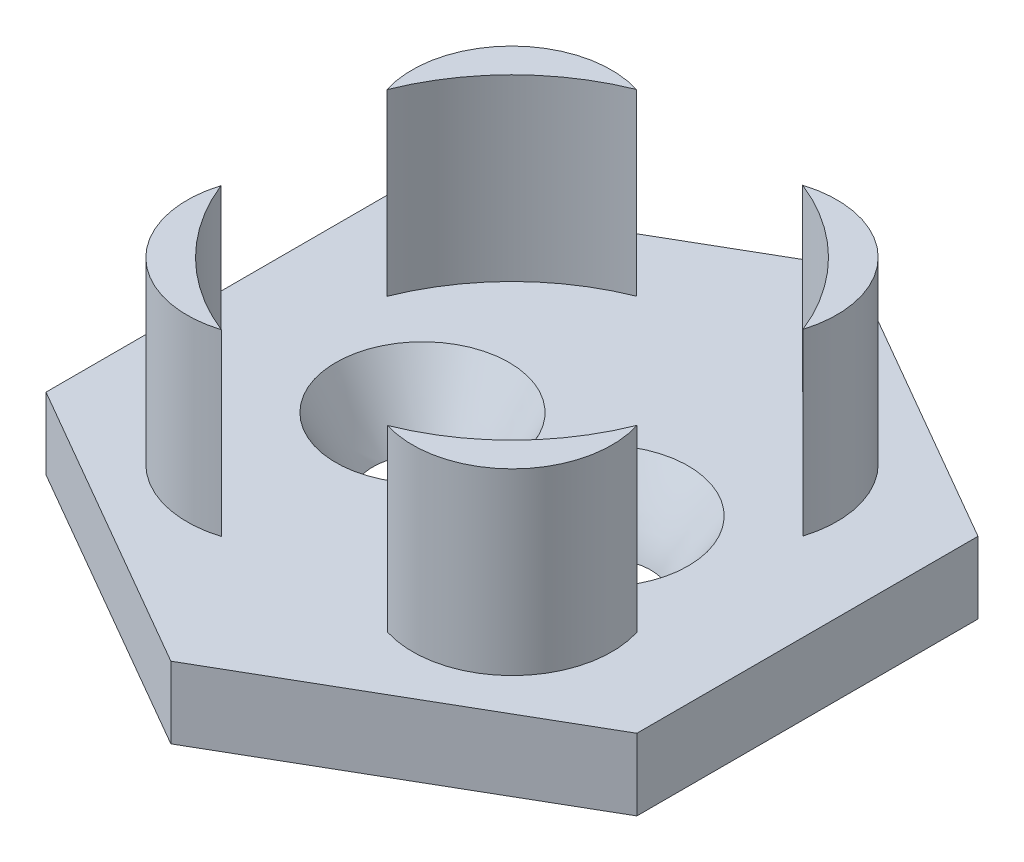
ISO-10303-21;
HEADER;
FILE_DESCRIPTION(('STEP AP214'),'2;1');
FILE_NAME('part.step','',(''),(''),'','','');
FILE_SCHEMA(('AUTOMOTIVE_DESIGN { 1 0 10303 214 1 1 1 1 }'));
ENDSEC;
DATA;
#1=APPLICATION_CONTEXT('core data for automotive mechanical design processes');
#2=APPLICATION_PROTOCOL_DEFINITION('international standard','automotive_design',2000,#1);
#3=PRODUCT_CONTEXT('',#1,'mechanical');
#4=PRODUCT('Part','Part','',(#3));
#5=PRODUCT_RELATED_PRODUCT_CATEGORY('part','',(#4));
#6=PRODUCT_DEFINITION_FORMATION('','',#4);
#7=PRODUCT_DEFINITION_CONTEXT('part definition',#1,'design');
#8=PRODUCT_DEFINITION('design','',#6,#7);
#9=PRODUCT_DEFINITION_SHAPE('','',#8);
#10=(LENGTH_UNIT() NAMED_UNIT(*) SI_UNIT(.MILLI.,.METRE.));
#11=(NAMED_UNIT(*) PLANE_ANGLE_UNIT() SI_UNIT($,.RADIAN.));
#12=(NAMED_UNIT(*) SI_UNIT($,.STERADIAN.) SOLID_ANGLE_UNIT());
#13=UNCERTAINTY_MEASURE_WITH_UNIT(LENGTH_MEASURE(1.E-05),#10,'distance_accuracy_value','');
#14=(GEOMETRIC_REPRESENTATION_CONTEXT(3) GLOBAL_UNCERTAINTY_ASSIGNED_CONTEXT((#13)) GLOBAL_UNIT_ASSIGNED_CONTEXT((#10,
#11,#12)) REPRESENTATION_CONTEXT('',''));
#15=CARTESIAN_POINT('',(0.,0.,0.));
#16=DIRECTION('',(0.,0.,1.));
#17=DIRECTION('',(1.,0.,0.));
#18=AXIS2_PLACEMENT_3D('',#15,#16,#17);
#19=CARTESIAN_POINT('',(0.,-1.651,-10.1003755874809));
#20=DIRECTION('',(0.,-1.,0.));
#21=DIRECTION('',(0.,0.,-1.));
#22=AXIS2_PLACEMENT_3D('',#19,#20,#21);
#23=PLANE('',#22);
#24=DIRECTION('',(0.,0.,1.));
#25=VECTOR('',#24,1.);
#26=CARTESIAN_POINT('',(4.19100000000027,-1.651,-10.1003755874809));
#27=LINE('',#26,#25);
#28=CARTESIAN_POINT('',(4.19100000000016,-1.651,-2.41967497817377));
#29=VERTEX_POINT('',#28);
#30=CARTESIAN_POINT('',(4.19100000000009,-1.651,2.41967497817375));
#31=VERTEX_POINT('',#30);
#32=EDGE_CURVE('E253',#29,#31,#27,.T.);
#33=ORIENTED_EDGE('',*,*,#32,.F.);
#34=DIRECTION('',(0.866025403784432,0.,0.500000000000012));
#35=VECTOR('',#34,1.);
#36=CARTESIAN_POINT('',(-2.27809092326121,-1.651,-6.154606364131));
#37=LINE('',#36,#35);
#38=CARTESIAN_POINT('',(1.34874750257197E-13,-1.651,-4.83934995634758));
#39=VERTEX_POINT('',#38);
#40=EDGE_CURVE('E260',#39,#29,#37,.T.);
#41=ORIENTED_EDGE('',*,*,#40,.F.);
#42=DIRECTION('',(0.866025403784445,0.,-0.499999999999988));
#43=VECTOR('',#42,1.);
#44=CARTESIAN_POINT('',(2.27809092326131,-1.651,-6.15460636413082));
#45=LINE('',#44,#43);
#46=CARTESIAN_POINT('',(-4.19099999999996,-1.651,-2.41967497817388));
#47=VERTEX_POINT('',#46);
#48=EDGE_CURVE('E279',#47,#39,#45,.T.);
#49=ORIENTED_EDGE('',*,*,#48,.F.);
#50=DIRECTION('',(0.,0.,-1.));
#51=VECTOR('',#50,1.);
#52=CARTESIAN_POINT('',(-4.19099999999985,-1.651,-10.100375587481));
#53=LINE('',#52,#51);
#54=CARTESIAN_POINT('',(-4.19100000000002,-1.651,2.41967497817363));
#55=VERTEX_POINT('',#54);
#56=EDGE_CURVE('E277',#55,#47,#53,.T.);
#57=ORIENTED_EDGE('',*,*,#56,.F.);
#58=DIRECTION('',(-0.866025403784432,0.,-0.500000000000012));
#59=VECTOR('',#58,1.);
#60=CARTESIAN_POINT('',(-6.46909092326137,-1.651,1.1044185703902));
#61=LINE('',#60,#59);
#62=CARTESIAN_POINT('',(0.,-1.651,4.83934995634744));
#63=VERTEX_POINT('',#62);
#64=EDGE_CURVE('E275',#63,#55,#61,.T.);
#65=ORIENTED_EDGE('',*,*,#64,.F.);
#66=DIRECTION('',(-0.866025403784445,0.,0.499999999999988));
#67=VECTOR('',#66,1.);
#68=CARTESIAN_POINT('',(6.46909092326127,-1.651,1.1044185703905));
#69=LINE('',#68,#67);
#70=EDGE_CURVE('E273',#31,#63,#69,.T.);
#71=ORIENTED_EDGE('',*,*,#70,.F.);
#72=EDGE_LOOP('',(#33,#41,#49,#57,#65,#71));
#73=FACE_BOUND('',#72,.T.);
#74=CARTESIAN_POINT('',(-1.59570779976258,-1.651,1.59972901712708));
#75=DIRECTION('',(0.,1.,0.));
#76=DIRECTION('',(0.,0.,1.));
#77=AXIS2_PLACEMENT_3D('',#74,#75,#76);
#78=CIRCLE('',#77,1.41393990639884);
#79=CARTESIAN_POINT('',(-2.94663960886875,-1.651,1.18234513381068));
#80=VERTEX_POINT('',#79);
#81=CARTESIAN_POINT('',(-1.17492515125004,-1.651,2.94960605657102));
#82=VERTEX_POINT('',#81);
#83=EDGE_CURVE('E244',#80,#82,#78,.T.);
#84=ORIENTED_EDGE('',*,*,#83,.F.);
#85=CARTESIAN_POINT('',(0.,-1.651,0.));
#86=DIRECTION('',(0.,1.,0.));
#87=DIRECTION('',(0.,0.,1.));
#88=AXIS2_PLACEMENT_3D('',#85,#86,#87);
#89=CIRCLE('',#88,3.17500000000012);
#90=EDGE_CURVE('E236',#80,#82,#89,.T.);
#91=ORIENTED_EDGE('',*,*,#90,.T.);
#92=EDGE_LOOP('',(#84,#91));
#93=FACE_BOUND('',#92,.T.);
#94=CARTESIAN_POINT('',(1.59972901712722,-1.651,1.59570779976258));
#95=DIRECTION('',(0.,1.,0.));
#96=DIRECTION('',(0.,0.,1.));
#97=AXIS2_PLACEMENT_3D('',#94,#95,#96);
#98=CIRCLE('',#97,1.41393990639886);
#99=CARTESIAN_POINT('',(1.1823451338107,-1.651,2.94663960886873));
#100=VERTEX_POINT('',#99);
#101=CARTESIAN_POINT('',(2.94960605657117,-1.651,1.17492515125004));
#102=VERTEX_POINT('',#101);
#103=EDGE_CURVE('E230',#100,#102,#98,.T.);
#104=ORIENTED_EDGE('',*,*,#103,.F.);
#105=CARTESIAN_POINT('',(-3.89879101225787E-13,-1.651,-4.27175655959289E-13));
#106=DIRECTION('',(0.,1.,0.));
#107=DIRECTION('',(0.,0.,1.));
#108=AXIS2_PLACEMENT_3D('',#105,#106,#107);
#109=CIRCLE('',#108,3.17500000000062);
#110=EDGE_CURVE('E233',#100,#102,#109,.T.);
#111=ORIENTED_EDGE('',*,*,#110,.T.);
#112=EDGE_LOOP('',(#104,#111));
#113=FACE_BOUND('',#112,.T.);
#114=CARTESIAN_POINT('',(-1.59972901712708,-1.651,-1.59570779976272));
#115=DIRECTION('',(0.,1.,0.));
#116=DIRECTION('',(0.,0.,1.));
#117=AXIS2_PLACEMENT_3D('',#114,#115,#116);
#118=CIRCLE('',#117,1.41393990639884);
#119=CARTESIAN_POINT('',(-1.18234513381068,-1.651,-2.94663960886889));
#120=VERTEX_POINT('',#119);
#121=CARTESIAN_POINT('',(-2.94960605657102,-1.651,-1.17492515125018));
#122=VERTEX_POINT('',#121);
#123=EDGE_CURVE('E110',#120,#122,#118,.T.);
#124=ORIENTED_EDGE('',*,*,#123,.F.);
#125=CARTESIAN_POINT('',(0.,-1.651,0.));
#126=DIRECTION('',(0.,1.,0.));
#127=DIRECTION('',(0.,0.,1.));
#128=AXIS2_PLACEMENT_3D('',#125,#126,#127);
#129=CIRCLE('',#128,3.17500000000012);
#130=EDGE_CURVE('E217',#120,#122,#129,.T.);
#131=ORIENTED_EDGE('',*,*,#130,.T.);
#132=EDGE_LOOP('',(#124,#131));
#133=FACE_BOUND('',#132,.T.);
#134=CARTESIAN_POINT('',(1.59570779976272,-1.651,-1.59972901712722));
#135=DIRECTION('',(0.,1.,0.));
#136=DIRECTION('',(0.,0.,1.));
#137=AXIS2_PLACEMENT_3D('',#134,#135,#136);
#138=CIRCLE('',#137,1.41393990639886);
#139=CARTESIAN_POINT('',(2.94663960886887,-1.651,-1.1823451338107));
#140=VERTEX_POINT('',#139);
#141=CARTESIAN_POINT('',(1.17492515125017,-1.651,-2.94960605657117));
#142=VERTEX_POINT('',#141);
#143=EDGE_CURVE('E103',#140,#142,#138,.T.);
#144=ORIENTED_EDGE('',*,*,#143,.F.);
#145=CARTESIAN_POINT('',(0.,-1.651,0.));
#146=DIRECTION('',(0.,1.,0.));
#147=DIRECTION('',(0.,0.,1.));
#148=AXIS2_PLACEMENT_3D('',#145,#146,#147);
#149=CIRCLE('',#148,3.17500000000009);
#150=EDGE_CURVE('E188',#140,#142,#149,.T.);
#151=ORIENTED_EDGE('',*,*,#150,.T.);
#152=EDGE_LOOP('',(#144,#151));
#153=FACE_BOUND('',#152,.T.);
#154=CARTESIAN_POINT('',(1.27,-1.651,0.));
#155=DIRECTION('',(0.,1.,0.));
#156=DIRECTION('',(0.,0.,1.));
#157=AXIS2_PLACEMENT_3D('',#154,#155,#156);
#158=CIRCLE('',#157,1.23);
#159=CARTESIAN_POINT('',(2.07876566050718,-1.651,0.926713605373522));
#160=VERTEX_POINT('',#159);
#161=EDGE_CURVE('E298',#160,#160,#158,.T.);
#162=ORIENTED_EDGE('',*,*,#161,.F.);
#163=EDGE_LOOP('',(#162));
#164=FACE_BOUND('',#163,.T.);
#165=CARTESIAN_POINT('',(-1.27,-1.651,0.));
#166=DIRECTION('',(0.,1.,0.));
#167=DIRECTION('',(0.,0.,1.));
#168=AXIS2_PLACEMENT_3D('',#165,#166,#167);
#169=CIRCLE('',#168,1.23);
#170=CARTESIAN_POINT('',(-2.30310541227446,-1.651,-0.667527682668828));
#171=VERTEX_POINT('',#170);
#172=EDGE_CURVE('E581',#171,#171,#169,.T.);
#173=ORIENTED_EDGE('',*,*,#172,.F.);
#174=EDGE_LOOP('',(#173));
#175=FACE_BOUND('',#174,.T.);
#176=ADVANCED_FACE('F85',(#73,#93,#113,#133,#153,#164,#175),#23,.F.);
#177=CARTESIAN_POINT('',(6.46909092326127,-2.667,1.1044185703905));
#178=DIRECTION('',(-0.499999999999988,0.,-0.866025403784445));
#179=DIRECTION('',(-0.866025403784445,0.,0.499999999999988));
#180=AXIS2_PLACEMENT_3D('',#177,#178,#179);
#181=PLANE('',#180);
#182=ORIENTED_EDGE('',*,*,#70,.T.);
#183=DIRECTION('',(0.,1.,0.));
#184=VECTOR('',#183,1.);
#185=CARTESIAN_POINT('',(0.,-2.667,4.83934995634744));
#186=LINE('',#185,#184);
#187=CARTESIAN_POINT('',(0.,-2.667,4.83934995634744));
#188=VERTEX_POINT('',#187);
#189=EDGE_CURVE('E96',#188,#63,#186,.T.);
#190=ORIENTED_EDGE('',*,*,#189,.F.);
#191=DIRECTION('',(-0.866025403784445,0.,0.499999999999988));
#192=VECTOR('',#191,1.);
#193=CARTESIAN_POINT('',(6.46909092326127,-2.667,1.1044185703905));
#194=LINE('',#193,#192);
#195=CARTESIAN_POINT('',(4.19100000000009,-2.667,2.41967497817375));
#196=VERTEX_POINT('',#195);
#197=EDGE_CURVE('E259',#196,#188,#194,.T.);
#198=ORIENTED_EDGE('',*,*,#197,.F.);
#199=DIRECTION('',(0.,1.,0.));
#200=VECTOR('',#199,1.);
#201=CARTESIAN_POINT('',(4.19100000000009,-2.667,2.41967497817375));
#202=LINE('',#201,#200);
#203=EDGE_CURVE('E12',#196,#31,#202,.T.);
#204=ORIENTED_EDGE('',*,*,#203,.T.);
#205=EDGE_LOOP('',(#182,#190,#198,#204));
#206=FACE_BOUND('',#205,.T.);
#207=ADVANCED_FACE('F311',(#206),#181,.F.);
#208=CARTESIAN_POINT('',(-6.46909092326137,-2.667,1.1044185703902));
#209=DIRECTION('',(0.500000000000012,0.,-0.866025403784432));
#210=DIRECTION('',(-0.866025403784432,0.,-0.500000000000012));
#211=AXIS2_PLACEMENT_3D('',#208,#209,#210);
#212=PLANE('',#211);
#213=ORIENTED_EDGE('',*,*,#64,.T.);
#214=DIRECTION('',(0.,1.,0.));
#215=VECTOR('',#214,1.);
#216=CARTESIAN_POINT('',(-4.19100000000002,-2.667,2.41967497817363));
#217=LINE('',#216,#215);
#218=CARTESIAN_POINT('',(-4.19100000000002,-2.667,2.41967497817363));
#219=VERTEX_POINT('',#218);
#220=EDGE_CURVE('E290',#219,#55,#217,.T.);
#221=ORIENTED_EDGE('',*,*,#220,.F.);
#222=DIRECTION('',(-0.866025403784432,0.,-0.500000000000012));
#223=VECTOR('',#222,1.);
#224=CARTESIAN_POINT('',(-6.46909092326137,-2.667,1.1044185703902));
#225=LINE('',#224,#223);
#226=EDGE_CURVE('E262',#188,#219,#225,.T.);
#227=ORIENTED_EDGE('',*,*,#226,.F.);
#228=ORIENTED_EDGE('',*,*,#189,.T.);
#229=EDGE_LOOP('',(#213,#221,#227,#228));
#230=FACE_BOUND('',#229,.T.);
#231=ADVANCED_FACE('F327',(#230),#212,.F.);
#232=CARTESIAN_POINT('',(-4.19099999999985,-2.667,-10.100375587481));
#233=DIRECTION('',(1.,0.,0.));
#234=DIRECTION('',(0.,0.,-1.));
#235=AXIS2_PLACEMENT_3D('',#232,#233,#234);
#236=PLANE('',#235);
#237=ORIENTED_EDGE('',*,*,#56,.T.);
#238=DIRECTION('',(0.,1.,0.));
#239=VECTOR('',#238,1.);
#240=CARTESIAN_POINT('',(-4.19099999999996,-2.667,-2.41967497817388));
#241=LINE('',#240,#239);
#242=CARTESIAN_POINT('',(-4.19099999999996,-2.667,-2.41967497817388));
#243=VERTEX_POINT('',#242);
#244=EDGE_CURVE('E287',#243,#47,#241,.T.);
#245=ORIENTED_EDGE('',*,*,#244,.F.);
#246=DIRECTION('',(0.,0.,-1.));
#247=VECTOR('',#246,1.);
#248=CARTESIAN_POINT('',(-4.19099999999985,-2.667,-10.100375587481));
#249=LINE('',#248,#247);
#250=EDGE_CURVE('E264',#219,#243,#249,.T.);
#251=ORIENTED_EDGE('',*,*,#250,.F.);
#252=ORIENTED_EDGE('',*,*,#220,.T.);
#253=EDGE_LOOP('',(#237,#245,#251,#252));
#254=FACE_BOUND('',#253,.T.);
#255=ADVANCED_FACE('F323',(#254),#236,.F.);
#256=CARTESIAN_POINT('',(2.27809092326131,-2.667,-6.15460636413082));
#257=DIRECTION('',(0.499999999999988,0.,0.866025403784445));
#258=DIRECTION('',(0.866025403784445,0.,-0.499999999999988));
#259=AXIS2_PLACEMENT_3D('',#256,#257,#258);
#260=PLANE('',#259);
#261=ORIENTED_EDGE('',*,*,#48,.T.);
#262=DIRECTION('',(0.,1.,0.));
#263=VECTOR('',#262,1.);
#264=CARTESIAN_POINT('',(1.34874750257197E-13,-2.667,-4.83934995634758));
#265=LINE('',#264,#263);
#266=CARTESIAN_POINT('',(1.34874750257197E-13,-2.667,-4.83934995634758));
#267=VERTEX_POINT('',#266);
#268=EDGE_CURVE('E284',#267,#39,#265,.T.);
#269=ORIENTED_EDGE('',*,*,#268,.F.);
#270=DIRECTION('',(0.866025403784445,0.,-0.499999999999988));
#271=VECTOR('',#270,1.);
#272=CARTESIAN_POINT('',(2.27809092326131,-2.667,-6.15460636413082));
#273=LINE('',#272,#271);
#274=EDGE_CURVE('E266',#243,#267,#273,.T.);
#275=ORIENTED_EDGE('',*,*,#274,.F.);
#276=ORIENTED_EDGE('',*,*,#244,.T.);
#277=EDGE_LOOP('',(#261,#269,#275,#276));
#278=FACE_BOUND('',#277,.T.);
#279=ADVANCED_FACE('F319',(#278),#260,.F.);
#280=CARTESIAN_POINT('',(-2.27809092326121,-2.667,-6.154606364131));
#281=DIRECTION('',(-0.500000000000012,0.,0.866025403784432));
#282=DIRECTION('',(0.866025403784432,0.,0.500000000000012));
#283=AXIS2_PLACEMENT_3D('',#280,#281,#282);
#284=PLANE('',#283);
#285=ORIENTED_EDGE('',*,*,#40,.T.);
#286=DIRECTION('',(0.,1.,0.));
#287=VECTOR('',#286,1.);
#288=CARTESIAN_POINT('',(4.19100000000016,-2.667,-2.41967497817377));
#289=LINE('',#288,#287);
#290=CARTESIAN_POINT('',(4.19100000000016,-2.667,-2.41967497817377));
#291=VERTEX_POINT('',#290);
#292=EDGE_CURVE('E270',#291,#29,#289,.T.);
#293=ORIENTED_EDGE('',*,*,#292,.F.);
#294=DIRECTION('',(0.866025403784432,0.,0.500000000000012));
#295=VECTOR('',#294,1.);
#296=CARTESIAN_POINT('',(-2.27809092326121,-2.667,-6.154606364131));
#297=LINE('',#296,#295);
#298=EDGE_CURVE('E268',#267,#291,#297,.T.);
#299=ORIENTED_EDGE('',*,*,#298,.F.);
#300=ORIENTED_EDGE('',*,*,#268,.T.);
#301=EDGE_LOOP('',(#285,#293,#299,#300));
#302=FACE_BOUND('',#301,.T.);
#303=ADVANCED_FACE('F315',(#302),#284,.F.);
#304=CARTESIAN_POINT('',(4.19100000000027,-2.667,-10.1003755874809));
#305=DIRECTION('',(-1.,0.,0.));
#306=DIRECTION('',(0.,0.,1.));
#307=AXIS2_PLACEMENT_3D('',#304,#305,#306);
#308=PLANE('',#307);
#309=ORIENTED_EDGE('',*,*,#32,.T.);
#310=ORIENTED_EDGE('',*,*,#203,.F.);
#311=DIRECTION('',(0.,0.,1.));
#312=VECTOR('',#311,1.);
#313=CARTESIAN_POINT('',(4.19100000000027,-2.667,-10.1003755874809));
#314=LINE('',#313,#312);
#315=EDGE_CURVE('E256',#291,#196,#314,.T.);
#316=ORIENTED_EDGE('',*,*,#315,.F.);
#317=ORIENTED_EDGE('',*,*,#292,.T.);
#318=EDGE_LOOP('',(#309,#310,#316,#317));
#319=FACE_BOUND('',#318,.T.);
#320=ADVANCED_FACE('F87',(#319),#308,.F.);
#321=CARTESIAN_POINT('',(0.,-2.667,-10.1003755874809));
#322=DIRECTION('',(0.,-1.,0.));
#323=DIRECTION('',(0.,0.,-1.));
#324=AXIS2_PLACEMENT_3D('',#321,#322,#323);
#325=PLANE('',#324);
#326=CARTESIAN_POINT('',(-1.27,-2.667,0.));
#327=DIRECTION('',(0.,-1.,0.));
#328=DIRECTION('',(0.,0.,-1.));
#329=AXIS2_PLACEMENT_3D('',#326,#327,#328);
#330=CIRCLE('',#329,0.7);
#331=CARTESIAN_POINT('',(-1.75965958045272,-2.667,-0.500233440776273));
#332=VERTEX_POINT('',#331);
#333=EDGE_CURVE('E368',#332,#332,#330,.T.);
#334=ORIENTED_EDGE('',*,*,#333,.F.);
#335=EDGE_LOOP('',(#334));
#336=FACE_BOUND('',#335,.T.);
#337=CARTESIAN_POINT('',(1.27,-2.667,0.));
#338=DIRECTION('',(0.,-1.,0.));
#339=DIRECTION('',(0.,0.,-1.));
#340=AXIS2_PLACEMENT_3D('',#337,#338,#339);
#341=CIRCLE('',#340,0.7);
#342=CARTESIAN_POINT('',(1.94972399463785,-2.667,0.167258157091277));
#343=VERTEX_POINT('',#342);
#344=EDGE_CURVE('E371',#343,#343,#341,.T.);
#345=ORIENTED_EDGE('',*,*,#344,.F.);
#346=EDGE_LOOP('',(#345));
#347=FACE_BOUND('',#346,.T.);
#348=ORIENTED_EDGE('',*,*,#315,.T.);
#349=ORIENTED_EDGE('',*,*,#197,.T.);
#350=ORIENTED_EDGE('',*,*,#226,.T.);
#351=ORIENTED_EDGE('',*,*,#250,.T.);
#352=ORIENTED_EDGE('',*,*,#274,.T.);
#353=ORIENTED_EDGE('',*,*,#298,.T.);
#354=EDGE_LOOP('',(#348,#349,#350,#351,#352,#353));
#355=FACE_BOUND('',#354,.T.);
#356=ADVANCED_FACE('F313',(#336,#347,#355),#325,.T.);
#357=CARTESIAN_POINT('',(0.,0.889,0.));
#358=DIRECTION('',(0.,-1.,0.));
#359=DIRECTION('',(0.,0.,-1.));
#360=AXIS2_PLACEMENT_3D('',#357,#358,#359);
#361=CYLINDRICAL_SURFACE('',#360,3.17500000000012);
#362=ORIENTED_EDGE('',*,*,#90,.F.);
#363=DIRECTION('',(0.,-1.,0.));
#364=VECTOR('',#363,1.);
#365=CARTESIAN_POINT('',(-2.94663960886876,0.889,1.18234513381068));
#366=LINE('',#365,#364);
#367=CARTESIAN_POINT('',(-2.94663960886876,0.889,1.18234513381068));
#368=VERTEX_POINT('',#367);
#369=EDGE_CURVE('E250',#368,#80,#366,.T.);
#370=ORIENTED_EDGE('',*,*,#369,.F.);
#371=CARTESIAN_POINT('',(0.,0.889,0.));
#372=DIRECTION('',(0.,1.,0.));
#373=DIRECTION('',(0.,0.,1.));
#374=AXIS2_PLACEMENT_3D('',#371,#372,#373);
#375=CIRCLE('',#374,3.17500000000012);
#376=CARTESIAN_POINT('',(-1.17492515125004,0.889,2.94960605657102));
#377=VERTEX_POINT('',#376);
#378=EDGE_CURVE('E240',#368,#377,#375,.T.);
#379=ORIENTED_EDGE('',*,*,#378,.T.);
#380=DIRECTION('',(0.,-1.,0.));
#381=VECTOR('',#380,1.);
#382=CARTESIAN_POINT('',(-1.17492515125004,0.889,2.94960605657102));
#383=LINE('',#382,#381);
#384=EDGE_CURVE('E246',#377,#82,#383,.T.);
#385=ORIENTED_EDGE('',*,*,#384,.T.);
#386=EDGE_LOOP('',(#362,#370,#379,#385));
#387=FACE_BOUND('',#386,.T.);
#388=ADVANCED_FACE('F358',(#387),#361,.F.);
#389=CARTESIAN_POINT('',(-1.59570779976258,0.889,1.59972901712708));
#390=DIRECTION('',(0.,-1.,0.));
#391=DIRECTION('',(0.,0.,-1.));
#392=AXIS2_PLACEMENT_3D('',#389,#390,#391);
#393=CYLINDRICAL_SURFACE('',#392,1.41393990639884);
#394=ORIENTED_EDGE('',*,*,#83,.T.);
#395=ORIENTED_EDGE('',*,*,#384,.F.);
#396=CARTESIAN_POINT('',(-1.59570779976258,0.889,1.59972901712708));
#397=DIRECTION('',(0.,1.,0.));
#398=DIRECTION('',(0.,0.,1.));
#399=AXIS2_PLACEMENT_3D('',#396,#397,#398);
#400=CIRCLE('',#399,1.41393990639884);
#401=EDGE_CURVE('E243',#368,#377,#400,.T.);
#402=ORIENTED_EDGE('',*,*,#401,.F.);
#403=ORIENTED_EDGE('',*,*,#369,.T.);
#404=EDGE_LOOP('',(#394,#395,#402,#403));
#405=FACE_BOUND('',#404,.T.);
#406=ADVANCED_FACE('F363',(#405),#393,.T.);
#407=CARTESIAN_POINT('',(-0.797853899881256,0.889,0.799864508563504));
#408=DIRECTION('',(0.,1.,0.));
#409=DIRECTION('',(0.,0.,1.));
#410=AXIS2_PLACEMENT_3D('',#407,#408,#409);
#411=PLANE('',#410);
#412=ORIENTED_EDGE('',*,*,#378,.F.);
#413=ORIENTED_EDGE('',*,*,#401,.T.);
#414=EDGE_LOOP('',(#412,#413));
#415=FACE_BOUND('',#414,.T.);
#416=ADVANCED_FACE('F429',(#415),#411,.T.);
#417=CARTESIAN_POINT('',(-3.89879101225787E-13,0.889,-4.27175655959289E-13));
#418=DIRECTION('',(0.,-1.,0.));
#419=DIRECTION('',(0.,0.,-1.));
#420=AXIS2_PLACEMENT_3D('',#417,#418,#419);
#421=CYLINDRICAL_SURFACE('',#420,3.17500000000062);
#422=ORIENTED_EDGE('',*,*,#110,.F.);
#423=DIRECTION('',(0.,-1.,0.));
#424=VECTOR('',#423,1.);
#425=CARTESIAN_POINT('',(1.1823451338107,0.889,2.94663960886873));
#426=LINE('',#425,#424);
#427=CARTESIAN_POINT('',(1.1823451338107,0.889,2.94663960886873));
#428=VERTEX_POINT('',#427);
#429=EDGE_CURVE('E220',#428,#100,#426,.T.);
#430=ORIENTED_EDGE('',*,*,#429,.F.);
#431=CARTESIAN_POINT('',(-3.89879101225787E-13,0.889,-4.27175655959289E-13));
#432=DIRECTION('',(0.,1.,0.));
#433=DIRECTION('',(0.,0.,1.));
#434=AXIS2_PLACEMENT_3D('',#431,#432,#433);
#435=CIRCLE('',#434,3.17500000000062);
#436=CARTESIAN_POINT('',(2.94960605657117,0.889,1.17492515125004));
#437=VERTEX_POINT('',#436);
#438=EDGE_CURVE('E234',#428,#437,#435,.T.);
#439=ORIENTED_EDGE('',*,*,#438,.T.);
#440=DIRECTION('',(0.,-1.,0.));
#441=VECTOR('',#440,1.);
#442=CARTESIAN_POINT('',(2.94960605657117,0.889,1.17492515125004));
#443=LINE('',#442,#441);
#444=EDGE_CURVE('E224',#437,#102,#443,.T.);
#445=ORIENTED_EDGE('',*,*,#444,.T.);
#446=EDGE_LOOP('',(#422,#430,#439,#445));
#447=FACE_BOUND('',#446,.T.);
#448=ADVANCED_FACE('F425',(#447),#421,.F.);
#449=CARTESIAN_POINT('',(1.59972901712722,0.889,1.59570779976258));
#450=DIRECTION('',(0.,-1.,0.));
#451=DIRECTION('',(0.,0.,-1.));
#452=AXIS2_PLACEMENT_3D('',#449,#450,#451);
#453=CYLINDRICAL_SURFACE('',#452,1.41393990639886);
#454=ORIENTED_EDGE('',*,*,#103,.T.);
#455=ORIENTED_EDGE('',*,*,#444,.F.);
#456=CARTESIAN_POINT('',(1.59972901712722,0.889,1.59570779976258));
#457=DIRECTION('',(0.,1.,0.));
#458=DIRECTION('',(0.,0.,1.));
#459=AXIS2_PLACEMENT_3D('',#456,#457,#458);
#460=CIRCLE('',#459,1.41393990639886);
#461=EDGE_CURVE('E227',#428,#437,#460,.T.);
#462=ORIENTED_EDGE('',*,*,#461,.F.);
#463=ORIENTED_EDGE('',*,*,#429,.T.);
#464=EDGE_LOOP('',(#454,#455,#462,#463));
#465=FACE_BOUND('',#464,.T.);
#466=ADVANCED_FACE('F428',(#465),#453,.T.);
#467=CARTESIAN_POINT('',(0.799864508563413,0.889,0.797853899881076));
#468=DIRECTION('',(0.,1.,0.));
#469=DIRECTION('',(0.,0.,1.));
#470=AXIS2_PLACEMENT_3D('',#467,#468,#469);
#471=PLANE('',#470);
#472=ORIENTED_EDGE('',*,*,#438,.F.);
#473=ORIENTED_EDGE('',*,*,#461,.T.);
#474=EDGE_LOOP('',(#472,#473));
#475=FACE_BOUND('',#474,.T.);
#476=ADVANCED_FACE('F417',(#475),#471,.T.);
#477=CARTESIAN_POINT('',(0.,0.889,0.));
#478=DIRECTION('',(0.,-1.,0.));
#479=DIRECTION('',(0.,0.,-1.));
#480=AXIS2_PLACEMENT_3D('',#477,#478,#479);
#481=CYLINDRICAL_SURFACE('',#480,3.17500000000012);
#482=ORIENTED_EDGE('',*,*,#130,.F.);
#483=DIRECTION('',(0.,-1.,0.));
#484=VECTOR('',#483,1.);
#485=CARTESIAN_POINT('',(-1.18234513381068,0.889,-2.94663960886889));
#486=LINE('',#485,#484);
#487=CARTESIAN_POINT('',(-1.18234513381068,0.889,-2.94663960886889));
#488=VERTEX_POINT('',#487);
#489=EDGE_CURVE('E192',#488,#120,#486,.T.);
#490=ORIENTED_EDGE('',*,*,#489,.F.);
#491=CARTESIAN_POINT('',(0.,0.889,0.));
#492=DIRECTION('',(0.,1.,0.));
#493=DIRECTION('',(0.,0.,1.));
#494=AXIS2_PLACEMENT_3D('',#491,#492,#493);
#495=CIRCLE('',#494,3.17500000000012);
#496=CARTESIAN_POINT('',(-2.94960605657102,0.889,-1.17492515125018));
#497=VERTEX_POINT('',#496);
#498=EDGE_CURVE('E218',#488,#497,#495,.T.);
#499=ORIENTED_EDGE('',*,*,#498,.T.);
#500=DIRECTION('',(0.,-1.,0.));
#501=VECTOR('',#500,1.);
#502=CARTESIAN_POINT('',(-2.94960605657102,0.889,-1.17492515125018));
#503=LINE('',#502,#501);
#504=EDGE_CURVE('E211',#497,#122,#503,.T.);
#505=ORIENTED_EDGE('',*,*,#504,.T.);
#506=EDGE_LOOP('',(#482,#490,#499,#505));
#507=FACE_BOUND('',#506,.T.);
#508=ADVANCED_FACE('F413',(#507),#481,.F.);
#509=CARTESIAN_POINT('',(-1.59972901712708,0.889,-1.59570779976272));
#510=DIRECTION('',(0.,-1.,0.));
#511=DIRECTION('',(0.,0.,-1.));
#512=AXIS2_PLACEMENT_3D('',#509,#510,#511);
#513=CYLINDRICAL_SURFACE('',#512,1.41393990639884);
#514=ORIENTED_EDGE('',*,*,#123,.T.);
#515=ORIENTED_EDGE('',*,*,#504,.F.);
#516=CARTESIAN_POINT('',(-1.59972901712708,0.889,-1.59570779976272));
#517=DIRECTION('',(0.,1.,0.));
#518=DIRECTION('',(0.,0.,1.));
#519=AXIS2_PLACEMENT_3D('',#516,#517,#518);
#520=CIRCLE('',#519,1.41393990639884);
#521=EDGE_CURVE('E214',#488,#497,#520,.T.);
#522=ORIENTED_EDGE('',*,*,#521,.F.);
#523=ORIENTED_EDGE('',*,*,#489,.T.);
#524=EDGE_LOOP('',(#514,#515,#522,#523));
#525=FACE_BOUND('',#524,.T.);
#526=ADVANCED_FACE('F416',(#525),#513,.T.);
#527=CARTESIAN_POINT('',(-0.799864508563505,0.889,-0.797853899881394));
#528=DIRECTION('',(0.,1.,0.));
#529=DIRECTION('',(0.,0.,1.));
#530=AXIS2_PLACEMENT_3D('',#527,#528,#529);
#531=PLANE('',#530);
#532=ORIENTED_EDGE('',*,*,#498,.F.);
#533=ORIENTED_EDGE('',*,*,#521,.T.);
#534=EDGE_LOOP('',(#532,#533));
#535=FACE_BOUND('',#534,.T.);
#536=ADVANCED_FACE('F407',(#535),#531,.T.);
#537=CARTESIAN_POINT('',(0.,0.889,0.));
#538=DIRECTION('',(0.,-1.,0.));
#539=DIRECTION('',(0.,0.,-1.));
#540=AXIS2_PLACEMENT_3D('',#537,#538,#539);
#541=CYLINDRICAL_SURFACE('',#540,3.17500000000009);
#542=ORIENTED_EDGE('',*,*,#150,.F.);
#543=DIRECTION('',(0.,-1.,0.));
#544=VECTOR('',#543,1.);
#545=CARTESIAN_POINT('',(2.94663960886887,0.889,-1.1823451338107));
#546=LINE('',#545,#544);
#547=CARTESIAN_POINT('',(2.94663960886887,0.889,-1.1823451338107));
#548=VERTEX_POINT('',#547);
#549=EDGE_CURVE('E203',#548,#140,#546,.T.);
#550=ORIENTED_EDGE('',*,*,#549,.F.);
#551=CARTESIAN_POINT('',(0.,0.889,0.));
#552=DIRECTION('',(0.,1.,0.));
#553=DIRECTION('',(0.,0.,1.));
#554=AXIS2_PLACEMENT_3D('',#551,#552,#553);
#555=CIRCLE('',#554,3.17500000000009);
#556=CARTESIAN_POINT('',(1.17492515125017,0.889,-2.94960605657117));
#557=VERTEX_POINT('',#556);
#558=EDGE_CURVE('E199',#548,#557,#555,.T.);
#559=ORIENTED_EDGE('',*,*,#558,.T.);
#560=DIRECTION('',(0.,-1.,0.));
#561=VECTOR('',#560,1.);
#562=CARTESIAN_POINT('',(1.17492515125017,0.889,-2.94960605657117));
#563=LINE('',#562,#561);
#564=EDGE_CURVE('E196',#557,#142,#563,.T.);
#565=ORIENTED_EDGE('',*,*,#564,.T.);
#566=EDGE_LOOP('',(#542,#550,#559,#565));
#567=FACE_BOUND('',#566,.T.);
#568=ADVANCED_FACE('F197',(#567),#541,.F.);
#569=CARTESIAN_POINT('',(1.59570779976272,0.889,-1.59972901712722));
#570=DIRECTION('',(0.,-1.,0.));
#571=DIRECTION('',(0.,0.,-1.));
#572=AXIS2_PLACEMENT_3D('',#569,#570,#571);
#573=CYLINDRICAL_SURFACE('',#572,1.41393990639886);
#574=ORIENTED_EDGE('',*,*,#143,.T.);
#575=ORIENTED_EDGE('',*,*,#564,.F.);
#576=CARTESIAN_POINT('',(1.59570779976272,0.889,-1.59972901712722));
#577=DIRECTION('',(0.,1.,0.));
#578=DIRECTION('',(0.,0.,1.));
#579=AXIS2_PLACEMENT_3D('',#576,#577,#578);
#580=CIRCLE('',#579,1.41393990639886);
#581=EDGE_CURVE('E202',#548,#557,#580,.T.);
#582=ORIENTED_EDGE('',*,*,#581,.F.);
#583=ORIENTED_EDGE('',*,*,#549,.T.);
#584=EDGE_LOOP('',(#574,#575,#582,#583));
#585=FACE_BOUND('',#584,.T.);
#586=ADVANCED_FACE('F205',(#585),#573,.T.);
#587=CARTESIAN_POINT('',(0.797853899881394,0.889,-0.799864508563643));
#588=DIRECTION('',(0.,1.,0.));
#589=DIRECTION('',(0.,0.,1.));
#590=AXIS2_PLACEMENT_3D('',#587,#588,#589);
#591=PLANE('',#590);
#592=ORIENTED_EDGE('',*,*,#558,.F.);
#593=ORIENTED_EDGE('',*,*,#581,.T.);
#594=EDGE_LOOP('',(#592,#593));
#595=FACE_BOUND('',#594,.T.);
#596=ADVANCED_FACE('F396',(#595),#591,.T.);
#597=CARTESIAN_POINT('',(1.94972399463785,-2.667,0.167258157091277));
#598=CARTESIAN_POINT('',(2.07876566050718,-1.651,0.926713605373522));
#599=CARTESIAN_POINT('',(2.2842403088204,-2.667,-1.19218983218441));
#600=CARTESIAN_POINT('',(3.93219287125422,-1.651,-0.690817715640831));
#601=CARTESIAN_POINT('',(0.924792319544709,-2.667,-1.52670614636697));
#602=CARTESIAN_POINT('',(2.31466155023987,-1.651,-2.54424492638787));
#603=CARTESIAN_POINT('',(0.590276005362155,-2.667,-0.167258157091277));
#604=CARTESIAN_POINT('',(0.461234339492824,-1.651,-0.926713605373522));
#605=CARTESIAN_POINT('',(0.2557596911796,-2.667,1.19218983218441));
#606=CARTESIAN_POINT('',(-1.39219287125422,-1.651,0.690817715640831));
#607=CARTESIAN_POINT('',(1.61520768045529,-2.667,1.52670614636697));
#608=CARTESIAN_POINT('',(0.225338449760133,-1.651,2.54424492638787));
#609=CARTESIAN_POINT('',(1.94972399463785,-2.667,0.167258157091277));
#610=CARTESIAN_POINT('',(2.07876566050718,-1.651,0.926713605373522));
#611=(BOUNDED_SURFACE() B_SPLINE_SURFACE(3,1,((#597,#598),(#599,#600),(#601,#602),(#603,#604),
(#605,#606),(#607,#608),(#609,#610)),.UNSPECIFIED.,.T.,.F.,.F.) B_SPLINE_SURFACE_WITH_KNOTS((4,
3,4),(2,2),(0.,0.5,1.),(0.,1.),
.UNSPECIFIED.) GEOMETRIC_REPRESENTATION_ITEM() RATIONAL_B_SPLINE_SURFACE(((1.,1.),
(0.333333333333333,0.333333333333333),(0.333333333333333,0.333333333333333),(1.,1.),
(0.333333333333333,0.333333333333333),(0.333333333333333,0.333333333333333),(1.,1.))) REPRESENTATION_ITEM('') SURFACE());
#612=CARTESIAN_POINT('',(1.94972399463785,-2.667,0.167258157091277));
#613=CARTESIAN_POINT('',(1.95106817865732,-2.65641666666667,0.175169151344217));
#614=CARTESIAN_POINT('',(1.95241236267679,-2.64583333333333,0.183080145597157));
#615=CARTESIAN_POINT('',(1.95510073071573,-2.62466666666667,0.198902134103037));
#616=CARTESIAN_POINT('',(1.95644491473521,-2.61408333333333,0.206813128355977));
#617=CARTESIAN_POINT('',(1.95913328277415,-2.59291666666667,0.222635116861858));
#618=CARTESIAN_POINT('',(1.96047746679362,-2.58233333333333,0.230546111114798));
#619=CARTESIAN_POINT('',(1.96316583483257,-2.56116666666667,0.246368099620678));
#620=CARTESIAN_POINT('',(1.96451001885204,-2.55058333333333,0.254279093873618));
#621=CARTESIAN_POINT('',(1.96719838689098,-2.52941666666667,0.270101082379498));
#622=CARTESIAN_POINT('',(1.96854257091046,-2.51883333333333,0.278012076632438));
#623=CARTESIAN_POINT('',(1.9712309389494,-2.49766666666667,0.293834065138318));
#624=CARTESIAN_POINT('',(1.97257512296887,-2.48708333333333,0.301745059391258));
#625=CARTESIAN_POINT('',(1.97526349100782,-2.46591666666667,0.317567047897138));
#626=CARTESIAN_POINT('',(1.97660767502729,-2.45533333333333,0.325478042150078));
#627=CARTESIAN_POINT('',(1.97929604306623,-2.43416666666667,0.341300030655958));
#628=CARTESIAN_POINT('',(1.98064022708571,-2.42358333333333,0.349211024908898));
#629=CARTESIAN_POINT('',(1.98332859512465,-2.40241666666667,0.365033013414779));
#630=CARTESIAN_POINT('',(1.98467277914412,-2.39183333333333,0.372944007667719));
#631=CARTESIAN_POINT('',(1.98736114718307,-2.37066666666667,0.388765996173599));
#632=CARTESIAN_POINT('',(1.98870533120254,-2.36008333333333,0.396676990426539));
#633=CARTESIAN_POINT('',(1.99139369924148,-2.33891666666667,0.412498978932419));
#634=CARTESIAN_POINT('',(1.99273788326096,-2.32833333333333,0.420409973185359));
#635=CARTESIAN_POINT('',(1.9954262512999,-2.30716666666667,0.436231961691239));
#636=CARTESIAN_POINT('',(1.99677043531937,-2.29658333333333,0.444142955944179));
#637=CARTESIAN_POINT('',(1.99945880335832,-2.27541666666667,0.459964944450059));
#638=CARTESIAN_POINT('',(2.00080298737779,-2.26483333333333,0.467875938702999));
#639=CARTESIAN_POINT('',(2.00349135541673,-2.24366666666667,0.483697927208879));
#640=CARTESIAN_POINT('',(2.00483553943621,-2.23308333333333,0.491608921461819));
#641=CARTESIAN_POINT('',(2.00752390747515,-2.21191666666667,0.507430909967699));
#642=CARTESIAN_POINT('',(2.00886809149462,-2.20133333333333,0.515341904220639));
#643=CARTESIAN_POINT('',(2.01155645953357,-2.18016666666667,0.531163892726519));
#644=CARTESIAN_POINT('',(2.01290064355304,-2.16958333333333,0.539074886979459));
#645=CARTESIAN_POINT('',(2.01558901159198,-2.14841666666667,0.55489687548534));
#646=CARTESIAN_POINT('',(2.01693319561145,-2.13783333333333,0.56280786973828));
#647=CARTESIAN_POINT('',(2.0196215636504,-2.11666666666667,0.57862985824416));
#648=CARTESIAN_POINT('',(2.02096574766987,-2.10608333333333,0.5865408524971));
#649=CARTESIAN_POINT('',(2.02365411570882,-2.08491666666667,0.60236284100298));
#650=CARTESIAN_POINT('',(2.02499829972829,-2.07433333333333,0.61027383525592));
#651=CARTESIAN_POINT('',(2.02768666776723,-2.05316666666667,0.6260958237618));
#652=CARTESIAN_POINT('',(2.02903085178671,-2.04258333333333,0.63400681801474));
#653=CARTESIAN_POINT('',(2.03171921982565,-2.02141666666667,0.64982880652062));
#654=CARTESIAN_POINT('',(2.03306340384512,-2.01083333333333,0.65773980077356));
#655=CARTESIAN_POINT('',(2.03575177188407,-1.98966666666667,0.67356178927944));
#656=CARTESIAN_POINT('',(2.03709595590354,-1.97908333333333,0.68147278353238));
#657=CARTESIAN_POINT('',(2.03978432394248,-1.95791666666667,0.69729477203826));
#658=CARTESIAN_POINT('',(2.04112850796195,-1.94733333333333,0.7052057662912));
#659=CARTESIAN_POINT('',(2.0438168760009,-1.92616666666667,0.721027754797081));
#660=CARTESIAN_POINT('',(2.04516106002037,-1.91558333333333,0.728938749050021));
#661=CARTESIAN_POINT('',(2.04784942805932,-1.89441666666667,0.744760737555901));
#662=CARTESIAN_POINT('',(2.04919361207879,-1.88383333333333,0.752671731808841));
#663=CARTESIAN_POINT('',(2.05188198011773,-1.86266666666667,0.768493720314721));
#664=CARTESIAN_POINT('',(2.0532261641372,-1.85208333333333,0.776404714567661));
#665=CARTESIAN_POINT('',(2.05591453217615,-1.83091666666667,0.792226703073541));
#666=CARTESIAN_POINT('',(2.05725871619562,-1.82033333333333,0.800137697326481));
#667=CARTESIAN_POINT('',(2.05994708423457,-1.79916666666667,0.815959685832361));
#668=CARTESIAN_POINT('',(2.06129126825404,-1.78858333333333,0.823870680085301));
#669=CARTESIAN_POINT('',(2.06397963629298,-1.76741666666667,0.839692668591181));
#670=CARTESIAN_POINT('',(2.06532382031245,-1.75683333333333,0.847603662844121));
#671=CARTESIAN_POINT('',(2.0680121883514,-1.73566666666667,0.863425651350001));
#672=CARTESIAN_POINT('',(2.06935637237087,-1.72508333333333,0.871336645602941));
#673=CARTESIAN_POINT('',(2.07204474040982,-1.70391666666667,0.887158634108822));
#674=CARTESIAN_POINT('',(2.07338892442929,-1.69333333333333,0.895069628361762));
#675=CARTESIAN_POINT('',(2.07607729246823,-1.67216666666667,0.910891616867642));
#676=CARTESIAN_POINT('',(2.0774214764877,-1.66158333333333,0.918802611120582));
#677=CARTESIAN_POINT('',(2.07876566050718,-1.651,0.926713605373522));
#678=B_SPLINE_CURVE_WITH_KNOTS('',3,(#612,#613,#614,#615,#616,#617,#618,#619,#620,#621,#622,
#623,#624,#625,#626,#627,#628,#629,#630,#631,#632,#633,#634,#635,#636,#637,#638,#639,#640,#641,
#642,#643,#644,#645,#646,#647,#648,#649,#650,#651,#652,#653,#654,#655,#656,#657,#658,#659,#660,
#661,#662,#663,#664,#665,#666,#667,#668,#669,#670,#671,#672,#673,#674,#675,#676,#677),
.UNSPECIFIED.,.F.,.F.,(4,2,2,2,2,2,2,2,2,2,2,2,2,2,2,2,2,2,2,2,2,2,2,2,2,2,2,2,2,2,2,2,4),(0.,
0.0398444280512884,0.0796888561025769,0.119533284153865,0.159377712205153,0.199222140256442,
0.23906656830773,0.278910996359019,0.318755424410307,0.358599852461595,0.398444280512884,
0.438288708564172,0.47813313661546,0.517977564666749,0.557821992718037,0.597666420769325,
0.637510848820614,0.677355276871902,0.71719970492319,0.757044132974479,0.796888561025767,
0.836732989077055,0.876577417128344,0.916421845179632,0.956266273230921,0.996110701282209,
1.0359551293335,1.07579955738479,1.11564398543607,1.15548841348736,1.19533284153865,
1.23517726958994,1.27502169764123),.UNSPECIFIED.);
#679=EDGE_CURVE('BSEAM383',#343,#160,#678,.T.);
#680=ORIENTED_EDGE('',*,*,#344,.T.);
#681=ORIENTED_EDGE('',*,*,#161,.T.);
#682=ORIENTED_EDGE('',*,*,#679,.T.);
#683=ORIENTED_EDGE('',*,*,#679,.F.);
#684=EDGE_LOOP('',(#680,#682,#681,#683));
#685=FACE_BOUND('',#684,.T.);
#686=ADVANCED_FACE('F383',(#685),#611,.F.);
#687=CARTESIAN_POINT('',(-1.75965958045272,-2.667,-0.500233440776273));
#688=CARTESIAN_POINT('',(-2.30310541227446,-1.651,-0.667527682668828));
#689=CARTESIAN_POINT('',(-2.76012646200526,-2.667,0.479085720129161));
#690=CARTESIAN_POINT('',(-3.63816077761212,-1.651,1.39868314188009));
#691=CARTESIAN_POINT('',(-1.78080730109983,-2.667,1.47955260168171));
#692=CARTESIAN_POINT('',(-1.57194995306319,-1.651,2.73373850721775));
#693=CARTESIAN_POINT('',(-0.780340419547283,-2.667,0.500233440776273));
#694=CARTESIAN_POINT('',(-0.236894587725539,-1.651,0.667527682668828));
#695=CARTESIAN_POINT('',(0.220126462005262,-2.667,-0.47908572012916));
#696=CARTESIAN_POINT('',(1.09816077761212,-1.651,-1.39868314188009));
#697=CARTESIAN_POINT('',(-0.759192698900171,-2.667,-1.47955260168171));
#698=CARTESIAN_POINT('',(-0.968050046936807,-1.651,-2.73373850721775));
#699=CARTESIAN_POINT('',(-1.75965958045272,-2.667,-0.500233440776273));
#700=CARTESIAN_POINT('',(-2.30310541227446,-1.651,-0.667527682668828));
#701=(BOUNDED_SURFACE() B_SPLINE_SURFACE(3,1,((#687,#688),(#689,#690),(#691,#692),(#693,#694),
(#695,#696),(#697,#698),(#699,#700)),.UNSPECIFIED.,.T.,.F.,.F.) B_SPLINE_SURFACE_WITH_KNOTS((4,
3,4),(2,2),(0.,0.5,1.),(0.,1.),
.UNSPECIFIED.) GEOMETRIC_REPRESENTATION_ITEM() RATIONAL_B_SPLINE_SURFACE(((1.,1.),
(0.333333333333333,0.333333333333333),(0.333333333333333,0.333333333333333),(1.,1.),
(0.333333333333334,0.333333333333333),(0.333333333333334,0.333333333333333),(1.,1.))) REPRESENTATION_ITEM('') SURFACE());
#702=CARTESIAN_POINT('',(-1.75965958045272,-2.667,-0.500233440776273));
#703=CARTESIAN_POINT('',(-1.76532047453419,-2.65641666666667,-0.501976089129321));
#704=CARTESIAN_POINT('',(-1.77098136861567,-2.64583333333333,-0.503718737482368));
#705=CARTESIAN_POINT('',(-1.78230315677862,-2.62466666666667,-0.507204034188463));
#706=CARTESIAN_POINT('',(-1.7879640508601,-2.61408333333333,-0.50894668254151));
#707=CARTESIAN_POINT('',(-1.79928583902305,-2.59291666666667,-0.512431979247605));
#708=CARTESIAN_POINT('',(-1.80494673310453,-2.58233333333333,-0.514174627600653));
#709=CARTESIAN_POINT('',(-1.81626852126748,-2.56116666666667,-0.517659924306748));
#710=CARTESIAN_POINT('',(-1.82192941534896,-2.55058333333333,-0.519402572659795));
#711=CARTESIAN_POINT('',(-1.83325120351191,-2.52941666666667,-0.52288786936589));
#712=CARTESIAN_POINT('',(-1.83891209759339,-2.51883333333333,-0.524630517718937));
#713=CARTESIAN_POINT('',(-1.85023388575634,-2.49766666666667,-0.528115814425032));
#714=CARTESIAN_POINT('',(-1.85589477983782,-2.48708333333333,-0.52985846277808));
#715=CARTESIAN_POINT('',(-1.86721656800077,-2.46591666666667,-0.533343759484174));
#716=CARTESIAN_POINT('',(-1.87287746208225,-2.45533333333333,-0.535086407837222));
#717=CARTESIAN_POINT('',(-1.8841992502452,-2.43416666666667,-0.538571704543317));
#718=CARTESIAN_POINT('',(-1.88986014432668,-2.42358333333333,-0.540314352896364));
#719=CARTESIAN_POINT('',(-1.90118193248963,-2.40241666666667,-0.543799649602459));
#720=CARTESIAN_POINT('',(-1.90684282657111,-2.39183333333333,-0.545542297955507));
#721=CARTESIAN_POINT('',(-1.91816461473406,-2.37066666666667,-0.549027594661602));
#722=CARTESIAN_POINT('',(-1.92382550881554,-2.36008333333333,-0.550770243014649));
#723=CARTESIAN_POINT('',(-1.93514729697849,-2.33891666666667,-0.554255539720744));
#724=CARTESIAN_POINT('',(-1.94080819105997,-2.32833333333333,-0.555998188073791));
#725=CARTESIAN_POINT('',(-1.95212997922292,-2.30716666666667,-0.559483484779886));
#726=CARTESIAN_POINT('',(-1.95779087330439,-2.29658333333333,-0.561226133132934));
#727=CARTESIAN_POINT('',(-1.96911266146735,-2.27541666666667,-0.564711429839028));
#728=CARTESIAN_POINT('',(-1.97477355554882,-2.26483333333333,-0.566454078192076));
#729=CARTESIAN_POINT('',(-1.98609534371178,-2.24366666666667,-0.569939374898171));
#730=CARTESIAN_POINT('',(-1.99175623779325,-2.23308333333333,-0.571682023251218));
#731=CARTESIAN_POINT('',(-2.00307802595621,-2.21191666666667,-0.575167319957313));
#732=CARTESIAN_POINT('',(-2.00873892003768,-2.20133333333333,-0.576909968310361));
#733=CARTESIAN_POINT('',(-2.02006070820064,-2.18016666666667,-0.580395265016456));
#734=CARTESIAN_POINT('',(-2.02572160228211,-2.16958333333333,-0.582137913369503));
#735=CARTESIAN_POINT('',(-2.03704339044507,-2.14841666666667,-0.585623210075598));
#736=CARTESIAN_POINT('',(-2.04270428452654,-2.13783333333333,-0.587365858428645));
#737=CARTESIAN_POINT('',(-2.0540260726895,-2.11666666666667,-0.59085115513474));
#738=CARTESIAN_POINT('',(-2.05968696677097,-2.10608333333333,-0.592593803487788));
#739=CARTESIAN_POINT('',(-2.07100875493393,-2.08491666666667,-0.596079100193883));
#740=CARTESIAN_POINT('',(-2.0766696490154,-2.07433333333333,-0.59782174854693));
#741=CARTESIAN_POINT('',(-2.08799143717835,-2.05316666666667,-0.601307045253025));
#742=CARTESIAN_POINT('',(-2.09365233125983,-2.04258333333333,-0.603049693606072));
#743=CARTESIAN_POINT('',(-2.10497411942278,-2.02141666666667,-0.606534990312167));
#744=CARTESIAN_POINT('',(-2.11063501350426,-2.01083333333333,-0.608277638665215));
#745=CARTESIAN_POINT('',(-2.12195680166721,-1.98966666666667,-0.611762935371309));
#746=CARTESIAN_POINT('',(-2.12761769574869,-1.97908333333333,-0.613505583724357));
#747=CARTESIAN_POINT('',(-2.13893948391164,-1.95791666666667,-0.616990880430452));
#748=CARTESIAN_POINT('',(-2.14460037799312,-1.94733333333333,-0.618733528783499));
#749=CARTESIAN_POINT('',(-2.15592216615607,-1.92616666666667,-0.622218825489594));
#750=CARTESIAN_POINT('',(-2.16158306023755,-1.91558333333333,-0.623961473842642));
#751=CARTESIAN_POINT('',(-2.1729048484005,-1.89441666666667,-0.627446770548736));
#752=CARTESIAN_POINT('',(-2.17856574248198,-1.88383333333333,-0.629189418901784));
#753=CARTESIAN_POINT('',(-2.18988753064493,-1.86266666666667,-0.632674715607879));
#754=CARTESIAN_POINT('',(-2.19554842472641,-1.85208333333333,-0.634417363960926));
#755=CARTESIAN_POINT('',(-2.20687021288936,-1.83091666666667,-0.637902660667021));
#756=CARTESIAN_POINT('',(-2.21253110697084,-1.82033333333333,-0.639645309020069));
#757=CARTESIAN_POINT('',(-2.22385289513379,-1.79916666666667,-0.643130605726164));
#758=CARTESIAN_POINT('',(-2.22951378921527,-1.78858333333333,-0.644873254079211));
#759=CARTESIAN_POINT('',(-2.24083557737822,-1.76741666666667,-0.648358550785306));
#760=CARTESIAN_POINT('',(-2.2464964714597,-1.75683333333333,-0.650101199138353));
#761=CARTESIAN_POINT('',(-2.25781825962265,-1.73566666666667,-0.653586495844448));
#762=CARTESIAN_POINT('',(-2.26347915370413,-1.72508333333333,-0.655329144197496));
#763=CARTESIAN_POINT('',(-2.27480094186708,-1.70391666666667,-0.658814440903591));
#764=CARTESIAN_POINT('',(-2.28046183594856,-1.69333333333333,-0.660557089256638));
#765=CARTESIAN_POINT('',(-2.29178362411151,-1.67216666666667,-0.664042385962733));
#766=CARTESIAN_POINT('',(-2.29744451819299,-1.66158333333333,-0.66578503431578));
#767=CARTESIAN_POINT('',(-2.30310541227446,-1.651,-0.667527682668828));
#768=B_SPLINE_CURVE_WITH_KNOTS('',3,(#702,#703,#704,#705,#706,#707,#708,#709,#710,#711,#712,
#713,#714,#715,#716,#717,#718,#719,#720,#721,#722,#723,#724,#725,#726,#727,#728,#729,#730,#731,
#732,#733,#734,#735,#736,#737,#738,#739,#740,#741,#742,#743,#744,#745,#746,#747,#748,#749,#750,
#751,#752,#753,#754,#755,#756,#757,#758,#759,#760,#761,#762,#763,#764,#765,#766,#767),
.UNSPECIFIED.,.F.,.F.,(4,2,2,2,2,2,2,2,2,2,2,2,2,2,2,2,2,2,2,2,2,2,2,2,2,2,2,2,2,2,2,2,4),(0.,
0.0363841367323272,0.0727682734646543,0.109152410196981,0.145536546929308,0.181920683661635,
0.218304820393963,0.25468895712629,0.291073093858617,0.327457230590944,0.363841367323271,
0.400225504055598,0.436609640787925,0.472993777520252,0.509377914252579,0.545762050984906,
0.582146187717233,0.61853032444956,0.654914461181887,0.691298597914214,0.727682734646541,
0.764066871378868,0.800451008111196,0.836835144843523,0.87321928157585,0.909603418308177,
0.945987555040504,0.982371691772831,1.01875582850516,1.05513996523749,1.09152410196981,
1.12790823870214,1.16429237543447),.UNSPECIFIED.);
#769=EDGE_CURVE('BSEAM395',#332,#171,#768,.T.);
#770=ORIENTED_EDGE('',*,*,#333,.T.);
#771=ORIENTED_EDGE('',*,*,#172,.T.);
#772=ORIENTED_EDGE('',*,*,#769,.T.);
#773=ORIENTED_EDGE('',*,*,#769,.F.);
#774=EDGE_LOOP('',(#770,#772,#771,#773));
#775=FACE_BOUND('',#774,.T.);
#776=ADVANCED_FACE('F395',(#775),#701,.F.);
#777=CLOSED_SHELL('',(#176,#207,#231,#255,#279,#303,#320,#356,#388,#406,#416,#448,#466,#476,
#508,#526,#536,#568,#586,#596,#686,#776));
#778=MANIFOLD_SOLID_BREP('B2',#777);
#779=ADVANCED_BREP_SHAPE_REPRESENTATION('',(#18,#778),#14);
#780=SHAPE_DEFINITION_REPRESENTATION(#9,#779);
ENDSEC;
END-ISO-10303-21;
